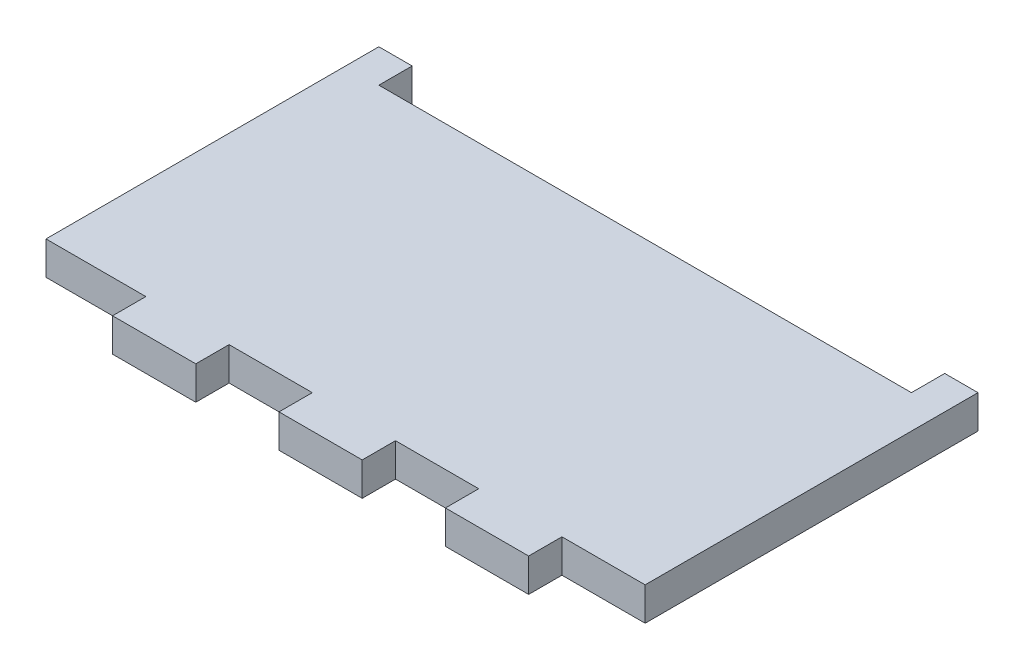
from build123d import *

# Parameters (mm, degrees)
SKETCH1_W           = 36
SKETCH1_H           = 2
BOSS_EXTRUDE1_DEPTH = 18
SKETCH2_W           = 2
SKETCH2_H           = 2
BOSS_EXTRUDE2_DEPTH = 2
SKETCH3_W           = 5
SKETCH3_H           = 2
BOSS_EXTRUDE3_DEPTH = 2
LPATTERN1_COUNT     = 3
LPATTERN1_PITCH     = 10


with BuildPart() as part:
    # Sketch1 → Boss-Extrude1 (new body)
    with BuildSketch(Plane.XY):
        with Locations((0, -6.5)):
            Rectangle(SKETCH1_W, SKETCH1_H)
    extrude(amount=BOSS_EXTRUDE1_DEPTH)

    # Sketch2 → Boss-Extrude2 (add)
    with BuildSketch(Plane(origin=(0, 0, 0), x_dir=(-1, 0, 0), z_dir=(0, 0, -1))):
        with Locations((17, -6.5)):
            Rectangle(SKETCH2_W, SKETCH2_H)
    boss_extrude2 = extrude(amount=BOSS_EXTRUDE2_DEPTH)

    # Mirror1: Boss-Extrude2 across plane
    add(boss_extrude2.mirror(Plane(origin=(0, 0, 0), x_dir=(0, 0, 1), z_dir=(1, 0, 0))))

    # Sketch3 → Boss-Extrude3 (add)
    with BuildSketch(Plane.XY.offset(18)):
        with Locations((10.5, -6.5)):
            Rectangle(SKETCH3_W, SKETCH3_H)
    boss_extrude3 = extrude(amount=BOSS_EXTRUDE3_DEPTH)

    # LPattern1: Boss-Extrude3 ×3
    with Locations(*[(-i * LPATTERN1_PITCH, 0, 0) for i in range(1, LPATTERN1_COUNT)]):
        add(boss_extrude3)


solid = part.part
